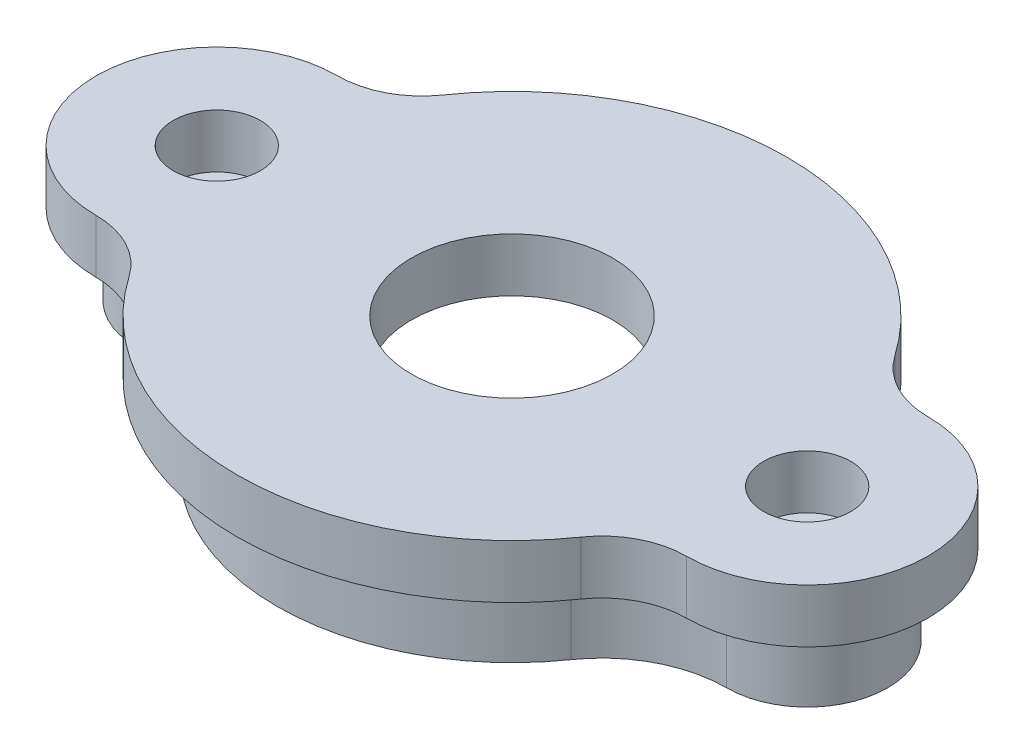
from build123d import *

# Parameters (mm, degrees)
BOSS_EXTRUDE1_DEPTH = 4
BOSS_EXTRUDE2_DEPTH = 6
HOLE1_D             = 3.5
HOLE1_CBORE_D       = 6.5
HOLE1_CBORE_DEPTH   = 4
HOLE2_D             = 15
HOLE2_CBORE_D       = 32
HOLE2_CBORE_DEPTH   = 6


with BuildPart() as part:
    # Sketch1 → Boss-Extrude1 (new body)
    with BuildSketch(Plane(origin=(0, 0, 0), x_dir=(1, 0, 0), z_dir=(0, 1, 0))):
        with BuildLine():
            ThreePointArc((-16.832454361, -11.701217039), (0, -20.5), (16.832454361, -11.701217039))
            ThreePointArc((16.832454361, -11.701217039), (19.084519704, -9.716037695), (22, -9))
            ThreePointArc((22, -9), (31, 0), (22, 9))
            ThreePointArc((22, 9), (19.084519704, 9.716037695), (16.832454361, 11.701217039))
            ThreePointArc((16.832454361, 11.701217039), (0, 20.5), (-16.832454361, 11.701217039))
            ThreePointArc((-16.832454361, 11.701217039), (-19.084519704, 9.716037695), (-22, 9))
            ThreePointArc((-22, 9), (-31, 0), (-22, -9))
            ThreePointArc((-22, -9), (-19.084519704, -9.716037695), (-16.832454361, -11.701217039))
        make_face()
    extrude(amount=BOSS_EXTRUDE1_DEPTH)

    # Sketch2 → Boss-Extrude2 (add)
    with BuildSketch(Plane.XZ):
        with BuildLine():
            ThreePointArc((14.369168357, 9.988843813), (17.694757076, 7.057361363), (22, 6))
            ThreePointArc((22, 6), (28, 0), (22, -6))
            ThreePointArc((22, -6), (17.694757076, -7.057361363), (14.369168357, -9.988843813))
            ThreePointArc((14.369168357, -9.988843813), (0, -17.5), (-14.369168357, -9.988843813))
            ThreePointArc((-14.369168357, -9.988843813), (-17.694757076, -7.057361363), (-22, -6))
            ThreePointArc((-22, -6), (-28, 0), (-22, 6))
            ThreePointArc((-22, 6), (-17.694757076, 7.057361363), (-14.369168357, 9.988843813))
            ThreePointArc((-14.369168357, 9.988843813), (0, 17.5), (14.369168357, 9.988843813))
        make_face()
    extrude(amount=BOSS_EXTRUDE2_DEPTH)

    # Hole1 (through all)
    with Locations(Plane(origin=(0, 4, 0), x_dir=(1, 0, 0), z_dir=(0, 1, 0))):
        with Locations((22, 0), (-22, 0)):
            CounterBoreHole(HOLE1_D / 2, HOLE1_CBORE_D / 2, HOLE1_CBORE_DEPTH)

    # Hole2 (through all)
    with Locations(Plane(origin=(0, -6, 0), x_dir=(-1, 0, 0), z_dir=(0, -1, 0))):
        with Locations((0, 0)):
            CounterBoreHole(HOLE2_D / 2, HOLE2_CBORE_D / 2, HOLE2_CBORE_DEPTH)


solid = part.part
